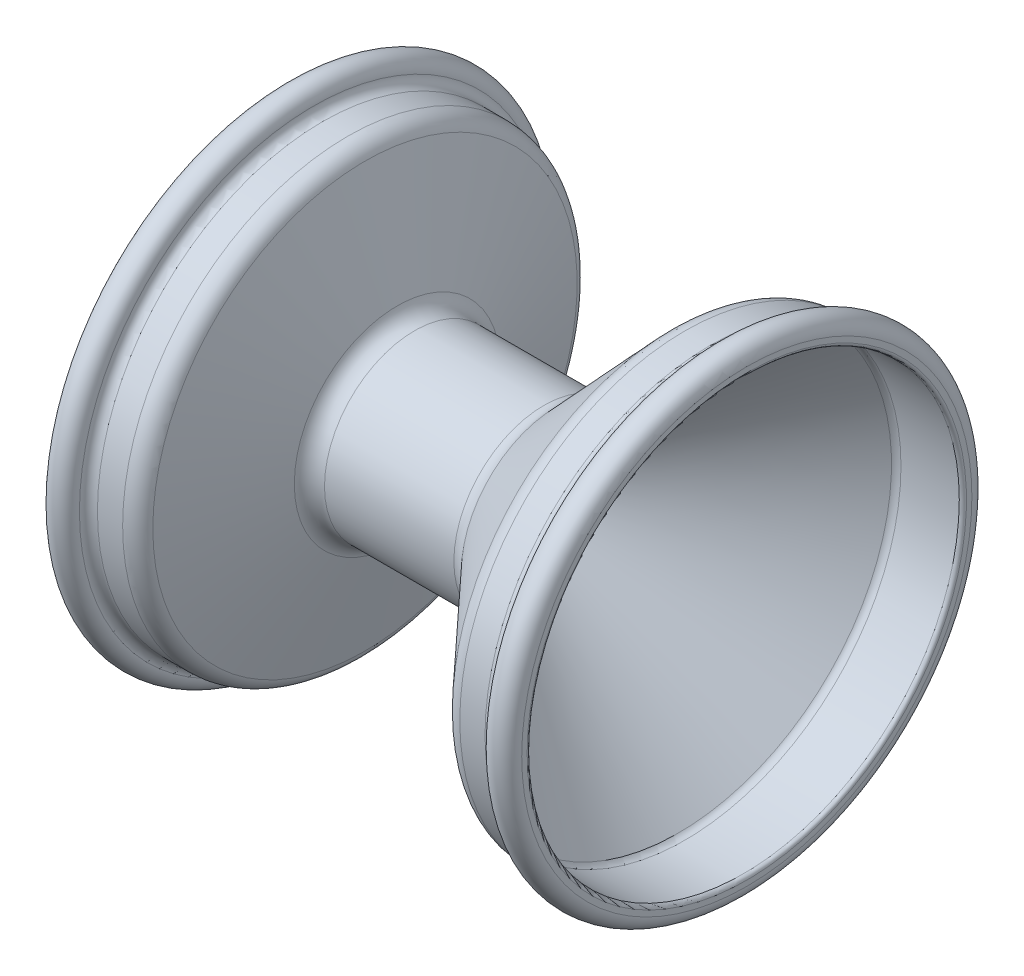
from build123d import *

# Parameters (mm, degrees)
ESQUISSE2_R             = 5
ENL_V_MAT_EXTRU_1_DEPTH = 161.438361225


with BuildPart() as part:
    # Esquisse1 → Base-R_volution (revolve)
    with BuildSketch(Plane.XY, mode=Mode.PRIVATE) as base_r_volution_sk:
        with BuildLine():
            Line((-91.74427744, 65), (-91.74427744, 61))
            ThreePointArc((-91.74427744, 61), (-91.451384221, 60.292893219), (-90.74427744, 60))
            Line((-90.74427744, 60), (-74.555203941, 60))
            ThreePointArc((-74.555203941, 60), (-73.058557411, 59.502510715), (-72.15756337, 58.208039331))
            Line((-72.15756337, 58.208039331), (-64.245717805, 31.416078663))
            ThreePointArc((-64.245717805, 31.416078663), (-65.035977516, 27.00670694), (-69.040998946, 25))
            Line((-69.040998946, 25), (-84.74427744, 25))
            Line((-84.74427744, 25), (-84.74427744, 20))
            Line((-84.74427744, 20), (-72.74427744, 20))
            Line((-72.74427744, 20), (-72.74427744, 18))
            Line((-72.74427744, 18), (-33.457107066, 18))
            Line((-33.457107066, 18), (-33.457107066, 17.5))
            Line((-33.457107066, 17.5), (-21.457107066, 17.5))
            Line((-21.457107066, 17.5), (17.233992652, 59.200403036))
            ThreePointArc((17.233992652, 59.200403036), (18.06690099, 59.791397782), (19.066649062, 60))
            Line((19.066649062, 60), (35.25572256, 60))
            ThreePointArc((35.25572256, 60), (35.962829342, 60.292893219), (36.25572256, 61))
            Line((36.25572256, 61), (36.25572256, 62.5))
            ThreePointArc((36.25572256, 62.5), (32.955680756, 66.51365455), (28.379817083, 64.051710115))
            ThreePointArc((28.379817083, 64.051710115), (27.459357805, 62.923858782), (26.066649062, 62.5))
            Line((26.066649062, 62.5), (19.066649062, 62.5))
            ThreePointArc((19.066649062, 62.5), (17.067152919, 62.082795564), (15.401336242, 60.900806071))
            Line((15.401336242, 60.900806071), (-16.424905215, 26.599193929))
            ThreePointArc((-16.424905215, 26.599193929), (-18.090721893, 25.417204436), (-20.090218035, 25))
            Line((-20.090218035, 25), (-56.007352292, 25))
            ThreePointArc((-56.007352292, 25), (-59.000645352, 25.99497857), (-60.802633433, 28.583921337))
            Line((-60.802633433, 28.583921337), (-69.7599228, 58.916078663))
            ThreePointArc((-69.7599228, 58.916078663), (-71.561910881, 61.50502143), (-74.555203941, 62.5))
            Line((-74.555203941, 62.5), (-81.555203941, 62.5))
            ThreePointArc((-81.555203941, 62.5), (-83.322970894, 63.232233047), (-84.055203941, 65))
            ThreePointArc((-84.055203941, 65), (-87.89974069, 68.844536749), (-91.74427744, 65))
        make_face()
    revolve(base_r_volution_sk.sketch.rotate(Axis((-112, 0, 0), (1, 0, 0)), 90), axis=Axis((-112, 0, 0), (1, 0, 0)))

    # Esquisse2 → Enl_v. mat.-Extru.1 (cut, through all)
    with BuildSketch(Plane(origin=(-0.511784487, 43.75, 0), x_dir=(0, 0, -1), z_dir=(-0.7330625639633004, 0.6801612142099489, 0))):
        with Locations(Location((0, -8.752000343, 0), (0, 0, 61.377473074))):
            Circle(ESQUISSE2_R)
    extrude(amount=-ENL_V_MAT_EXTRU_1_DEPTH, mode=Mode.SUBTRACT)


solid = part.part
